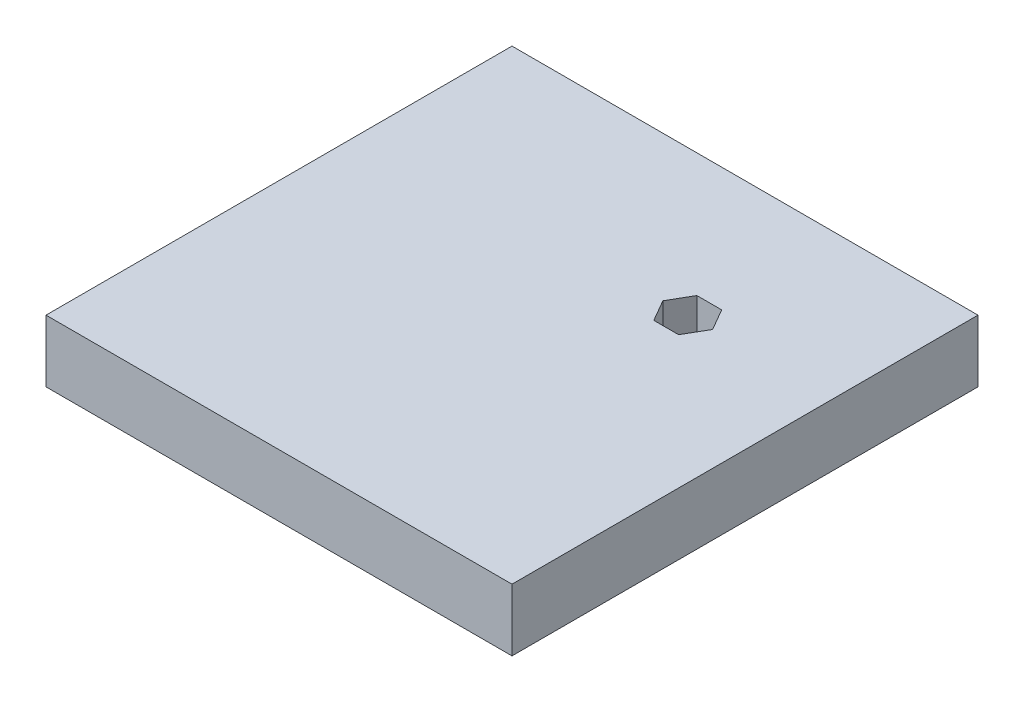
from build123d import *

# Parameters (mm, degrees)
SKETCH2_W          = 150
SKETCH2_H          = 150
EXTRUDE1_DEPTH     = 20
CUT_EXTRUDE1_DEPTH = 108.935165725


with BuildPart() as part:
    # Sketch2 → Extrude1 (new body)
    with BuildSketch(Plane(origin=(0, 0, 0), x_dir=(1, 0, 0), z_dir=(0, 1, 0))):
        Rectangle(SKETCH2_W, SKETCH2_H)
    extrude(amount=EXTRUDE1_DEPTH)

    # Sketch3 → Cut-Extrude1 (cut, through all)
    with BuildSketch(Plane(origin=(0, 20, 0), x_dir=(1, 0, 0), z_dir=(0, 1, 0))):
        Polygon((36.284271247, 28.284271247), (32.284271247, 35.212474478), (24.284271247, 35.212474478), (20.284271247, 28.284271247), (24.284271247, 21.356068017), (32.284271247, 21.356068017), align=None)
    extrude(amount=-CUT_EXTRUDE1_DEPTH, mode=Mode.SUBTRACT)


solid = part.part
